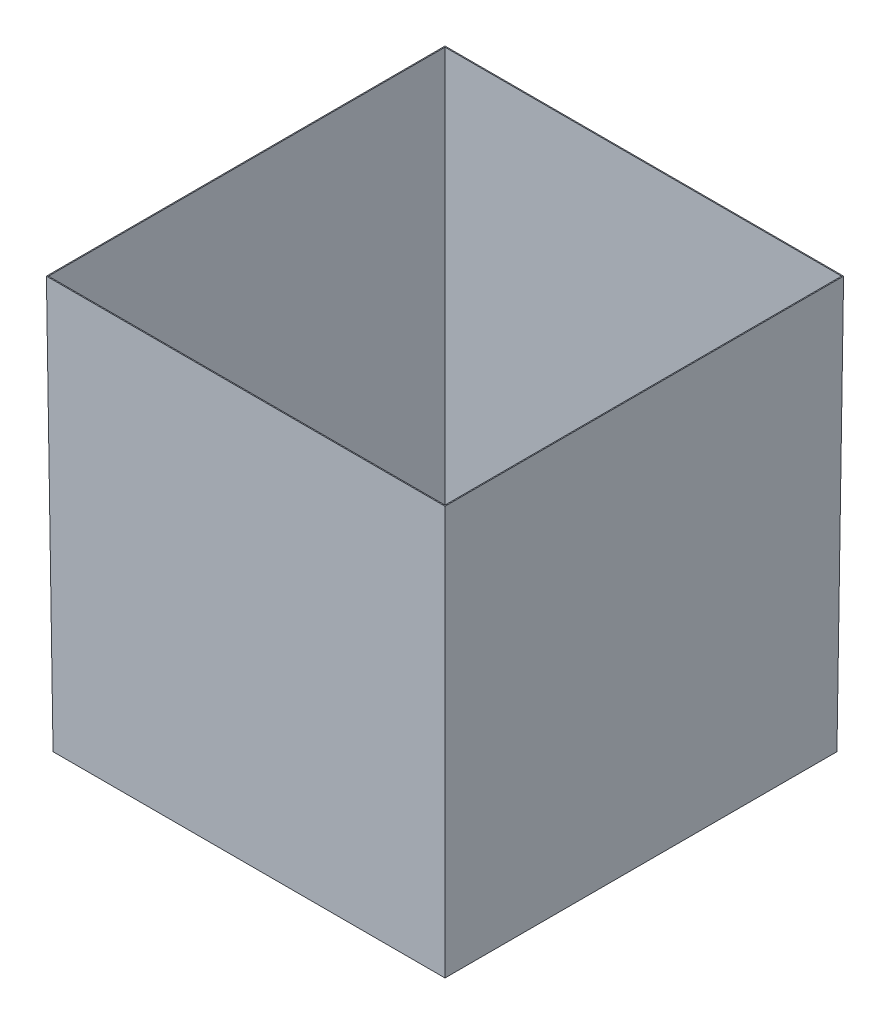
from build123d import *

# Parameters (mm, degrees)
SHELL_1_5_T = -1.5


with BuildPart() as part:
    # Sketch 1 → Loft 590-600_ H620 section 0
    with BuildSketch(Plane(origin=(0, 0, 0), x_dir=(1, 0, 0), z_dir=(0, 1, 0))):
        with BuildLine():
            Line((-295, -295), (295, -295))
            Line((295, -295), (295, 295))
            Line((295, 295), (-295, 295))
            Line((-295, 295), (-295, -295))
        make_face()
    # Sketch 2 → Loft 590-600_ H620 section 1
    with BuildSketch(Plane(origin=(0, 620, 0), x_dir=(1, 0, 0), z_dir=(0, 1, 0))):
        with BuildLine():
            Line((-300, -300), (300, -300))
            Line((300, -300), (300, 300))
            Line((300, 300), (-300, 300))
            Line((-300, 300), (-300, -300))
        make_face()
    loft()

    # Shell 1_5
    shell_1_5_openings = [part.faces().sort_by_distance(p)[0] for p in [
        (0, 620, 0),
    ]]
    offset(amount=SHELL_1_5_T, openings=shell_1_5_openings, kind=Kind.INTERSECTION)


solid = part.part
